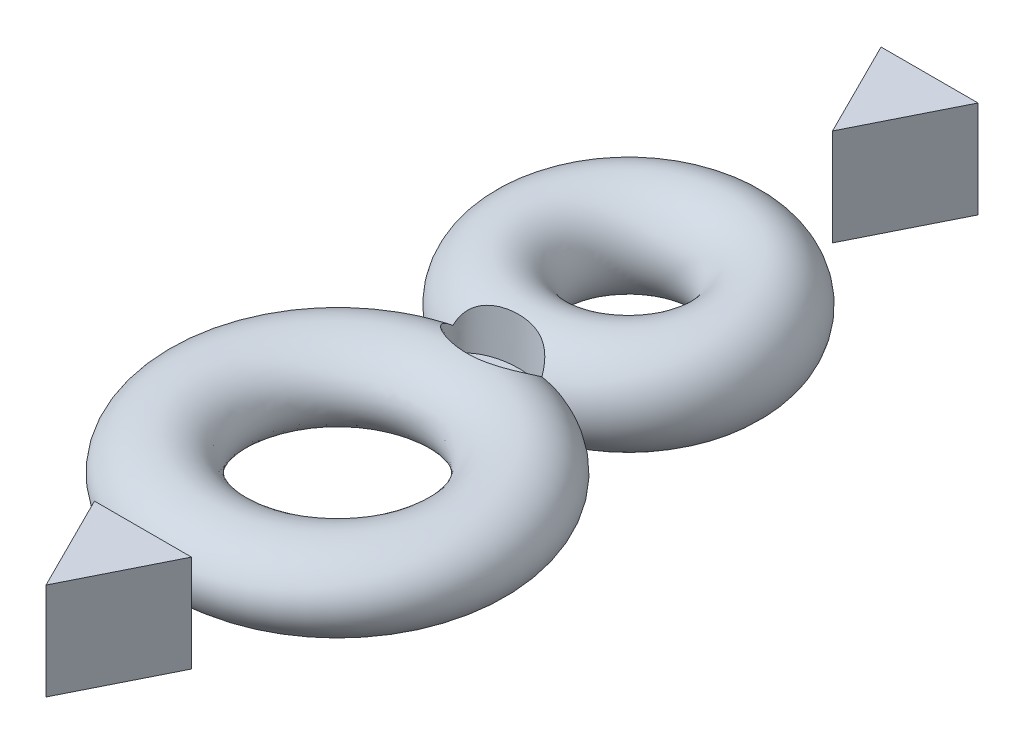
ISO-10303-21;
HEADER;
FILE_DESCRIPTION(('STEP AP214'),'2;1');
FILE_NAME('part.step','',(''),(''),'','','');
FILE_SCHEMA(('AUTOMOTIVE_DESIGN { 1 0 10303 214 1 1 1 1 }'));
ENDSEC;
DATA;
#1=APPLICATION_CONTEXT('core data for automotive mechanical design processes');
#2=APPLICATION_PROTOCOL_DEFINITION('international standard','automotive_design',2000,#1);
#3=PRODUCT_CONTEXT('',#1,'mechanical');
#4=PRODUCT('Part','Part','',(#3));
#5=PRODUCT_RELATED_PRODUCT_CATEGORY('part','',(#4));
#6=PRODUCT_DEFINITION_FORMATION('','',#4);
#7=PRODUCT_DEFINITION_CONTEXT('part definition',#1,'design');
#8=PRODUCT_DEFINITION('design','',#6,#7);
#9=PRODUCT_DEFINITION_SHAPE('','',#8);
#10=(LENGTH_UNIT() NAMED_UNIT(*) SI_UNIT(.MILLI.,.METRE.));
#11=(NAMED_UNIT(*) PLANE_ANGLE_UNIT() SI_UNIT($,.RADIAN.));
#12=(NAMED_UNIT(*) SI_UNIT($,.STERADIAN.) SOLID_ANGLE_UNIT());
#13=UNCERTAINTY_MEASURE_WITH_UNIT(LENGTH_MEASURE(1.E-05),#10,'distance_accuracy_value','');
#14=(GEOMETRIC_REPRESENTATION_CONTEXT(3) GLOBAL_UNCERTAINTY_ASSIGNED_CONTEXT((#13)) GLOBAL_UNIT_ASSIGNED_CONTEXT((#10,
#11,#12)) REPRESENTATION_CONTEXT('',''));
#15=CARTESIAN_POINT('',(0.,0.,0.));
#16=DIRECTION('',(0.,0.,1.));
#17=DIRECTION('',(1.,0.,0.));
#18=AXIS2_PLACEMENT_3D('',#15,#16,#17);
#19=CARTESIAN_POINT('',(0.,7.5,75.0979203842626));
#20=DIRECTION('',(0.894427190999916,0.,-0.447213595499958));
#21=DIRECTION('',(-0.447213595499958,0.,-0.894427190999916));
#22=AXIS2_PLACEMENT_3D('',#19,#20,#21);
#23=PLANE('',#22);
#24=DIRECTION('',(0.447213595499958,0.,0.894427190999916));
#25=VECTOR('',#24,1.);
#26=CARTESIAN_POINT('',(0.,-7.5,75.0979203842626));
#27=LINE('',#26,#25);
#28=CARTESIAN_POINT('',(-7.49999999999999,-7.5,60.0979203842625));
#29=VERTEX_POINT('',#28);
#30=CARTESIAN_POINT('',(0.,-7.5,75.0979203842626));
#31=VERTEX_POINT('',#30);
#32=EDGE_CURVE('E95',#29,#31,#27,.T.);
#33=ORIENTED_EDGE('',*,*,#32,.T.);
#34=DIRECTION('',(0.,-1.,0.));
#35=VECTOR('',#34,1.);
#36=CARTESIAN_POINT('',(0.,7.5,75.0979203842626));
#37=LINE('',#36,#35);
#38=CARTESIAN_POINT('',(0.,7.5,75.0979203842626));
#39=VERTEX_POINT('',#38);
#40=EDGE_CURVE('E12',#39,#31,#37,.T.);
#41=ORIENTED_EDGE('',*,*,#40,.F.);
#42=DIRECTION('',(0.447213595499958,0.,0.894427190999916));
#43=VECTOR('',#42,1.);
#44=CARTESIAN_POINT('',(0.,7.5,75.0979203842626));
#45=LINE('',#44,#43);
#46=CARTESIAN_POINT('',(-7.49999999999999,7.5,60.0979203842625));
#47=VERTEX_POINT('',#46);
#48=EDGE_CURVE('E88',#47,#39,#45,.T.);
#49=ORIENTED_EDGE('',*,*,#48,.F.);
#50=DIRECTION('',(0.,-1.,0.));
#51=VECTOR('',#50,1.);
#52=CARTESIAN_POINT('',(-7.49999999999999,7.5,60.0979203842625));
#53=LINE('',#52,#51);
#54=EDGE_CURVE('E96',#47,#29,#53,.T.);
#55=ORIENTED_EDGE('',*,*,#54,.T.);
#56=EDGE_LOOP('',(#33,#41,#49,#55));
#57=FACE_BOUND('',#56,.T.);
#58=ADVANCED_FACE('F48',(#57),#23,.F.);
#59=CARTESIAN_POINT('',(7.50000000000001,7.5,60.0979203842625));
#60=DIRECTION('',(-0.894427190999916,0.,-0.447213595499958));
#61=DIRECTION('',(-0.447213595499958,0.,0.894427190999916));
#62=AXIS2_PLACEMENT_3D('',#59,#60,#61);
#63=PLANE('',#62);
#64=DIRECTION('',(0.447213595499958,0.,-0.894427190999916));
#65=VECTOR('',#64,1.);
#66=CARTESIAN_POINT('',(7.50000000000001,-7.5,60.0979203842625));
#67=LINE('',#66,#65);
#68=CARTESIAN_POINT('',(7.50000000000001,-7.5,60.0979203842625));
#69=VERTEX_POINT('',#68);
#70=EDGE_CURVE('E76',#31,#69,#67,.T.);
#71=ORIENTED_EDGE('',*,*,#70,.T.);
#72=DIRECTION('',(0.,-1.,0.));
#73=VECTOR('',#72,1.);
#74=CARTESIAN_POINT('',(7.50000000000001,7.5,60.0979203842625));
#75=LINE('',#74,#73);
#76=CARTESIAN_POINT('',(7.50000000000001,7.5,60.0979203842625));
#77=VERTEX_POINT('',#76);
#78=EDGE_CURVE('E56',#77,#69,#75,.T.);
#79=ORIENTED_EDGE('',*,*,#78,.F.);
#80=DIRECTION('',(0.447213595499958,0.,-0.894427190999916));
#81=VECTOR('',#80,1.);
#82=CARTESIAN_POINT('',(7.50000000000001,7.5,60.0979203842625));
#83=LINE('',#82,#81);
#84=EDGE_CURVE('E84',#39,#77,#83,.T.);
#85=ORIENTED_EDGE('',*,*,#84,.F.);
#86=ORIENTED_EDGE('',*,*,#40,.T.);
#87=EDGE_LOOP('',(#71,#79,#85,#86));
#88=FACE_BOUND('',#87,.T.);
#89=ADVANCED_FACE('F85',(#88),#63,.F.);
#90=CARTESIAN_POINT('',(-7.49999999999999,7.5,60.0979203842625));
#91=DIRECTION('',(0.,0.,1.));
#92=DIRECTION('',(1.,0.,0.));
#93=AXIS2_PLACEMENT_3D('',#90,#91,#92);
#94=PLANE('',#93);
#95=DIRECTION('',(-1.,0.,0.));
#96=VECTOR('',#95,1.);
#97=CARTESIAN_POINT('',(-7.49999999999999,-7.5,60.0979203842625));
#98=LINE('',#97,#96);
#99=EDGE_CURVE('E81',#69,#29,#98,.T.);
#100=ORIENTED_EDGE('',*,*,#99,.T.);
#101=ORIENTED_EDGE('',*,*,#54,.F.);
#102=DIRECTION('',(-1.,0.,0.));
#103=VECTOR('',#102,1.);
#104=CARTESIAN_POINT('',(-7.49999999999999,7.5,60.0979203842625));
#105=LINE('',#104,#103);
#106=EDGE_CURVE('E64',#77,#47,#105,.T.);
#107=ORIENTED_EDGE('',*,*,#106,.F.);
#108=ORIENTED_EDGE('',*,*,#78,.T.);
#109=EDGE_LOOP('',(#100,#101,#107,#108));
#110=FACE_BOUND('',#109,.T.);
#111=ADVANCED_FACE('F103',(#110),#94,.F.);
#112=CARTESIAN_POINT('',(0.,7.5,0.));
#113=DIRECTION('',(0.,-1.,0.));
#114=DIRECTION('',(0.,0.,-1.));
#115=AXIS2_PLACEMENT_3D('',#112,#113,#114);
#116=PLANE('',#115);
#117=ORIENTED_EDGE('',*,*,#48,.T.);
#118=ORIENTED_EDGE('',*,*,#84,.T.);
#119=ORIENTED_EDGE('',*,*,#106,.T.);
#120=EDGE_LOOP('',(#117,#118,#119));
#121=FACE_BOUND('',#120,.T.);
#122=ADVANCED_FACE('F91',(#121),#116,.F.);
#123=CARTESIAN_POINT('',(0.,-7.5,0.));
#124=DIRECTION('',(0.,-1.,0.));
#125=DIRECTION('',(0.,0.,-1.));
#126=AXIS2_PLACEMENT_3D('',#123,#124,#125);
#127=PLANE('',#126);
#128=ORIENTED_EDGE('',*,*,#32,.F.);
#129=ORIENTED_EDGE('',*,*,#99,.F.);
#130=ORIENTED_EDGE('',*,*,#70,.F.);
#131=EDGE_LOOP('',(#128,#129,#130));
#132=FACE_BOUND('',#131,.T.);
#133=ADVANCED_FACE('F104',(#132),#127,.T.);
#134=CLOSED_SHELL('',(#58,#89,#111,#122,#133));
#135=MANIFOLD_SOLID_BREP('B2',#134);
#136=CARTESIAN_POINT('',(7.49999999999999,7.5,-61.5769876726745));
#137=DIRECTION('',(0.,0.,1.));
#138=DIRECTION('',(1.,0.,0.));
#139=AXIS2_PLACEMENT_3D('',#136,#137,#138);
#140=PLANE('',#139);
#141=DIRECTION('',(-1.,0.,0.));
#142=VECTOR('',#141,1.);
#143=CARTESIAN_POINT('',(7.49999999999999,-7.5,-61.5769876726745));
#144=LINE('',#143,#142);
#145=CARTESIAN_POINT('',(7.49999999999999,-7.5,-61.5769876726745));
#146=VERTEX_POINT('',#145);
#147=CARTESIAN_POINT('',(-7.50000000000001,-7.5,-61.5769876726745));
#148=VERTEX_POINT('',#147);
#149=EDGE_CURVE('E202',#146,#148,#144,.T.);
#150=ORIENTED_EDGE('',*,*,#149,.T.);
#151=DIRECTION('',(0.,-1.,0.));
#152=VECTOR('',#151,1.);
#153=CARTESIAN_POINT('',(-7.50000000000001,7.5,-61.5769876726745));
#154=LINE('',#153,#152);
#155=CARTESIAN_POINT('',(-7.50000000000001,7.5,-61.5769876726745));
#156=VERTEX_POINT('',#155);
#157=EDGE_CURVE('E46',#156,#148,#154,.T.);
#158=ORIENTED_EDGE('',*,*,#157,.F.);
#159=DIRECTION('',(-1.,0.,0.));
#160=VECTOR('',#159,1.);
#161=CARTESIAN_POINT('',(7.49999999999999,7.5,-61.5769876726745));
#162=LINE('',#161,#160);
#163=CARTESIAN_POINT('',(7.49999999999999,7.5,-61.5769876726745));
#164=VERTEX_POINT('',#163);
#165=EDGE_CURVE('E195',#164,#156,#162,.T.);
#166=ORIENTED_EDGE('',*,*,#165,.F.);
#167=DIRECTION('',(0.,-1.,0.));
#168=VECTOR('',#167,1.);
#169=CARTESIAN_POINT('',(7.49999999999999,7.5,-61.5769876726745));
#170=LINE('',#169,#168);
#171=EDGE_CURVE('E203',#164,#146,#170,.T.);
#172=ORIENTED_EDGE('',*,*,#171,.T.);
#173=EDGE_LOOP('',(#150,#158,#166,#172));
#174=FACE_BOUND('',#173,.T.);
#175=ADVANCED_FACE('F155',(#174),#140,.F.);
#176=CARTESIAN_POINT('',(-7.50000000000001,7.5,-61.5769876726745));
#177=DIRECTION('',(0.894427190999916,0.,-0.447213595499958));
#178=DIRECTION('',(-0.447213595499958,0.,-0.894427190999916));
#179=AXIS2_PLACEMENT_3D('',#176,#177,#178);
#180=PLANE('',#179);
#181=DIRECTION('',(0.447213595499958,0.,0.894427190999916));
#182=VECTOR('',#181,1.);
#183=CARTESIAN_POINT('',(-7.50000000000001,-7.5,-61.5769876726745));
#184=LINE('',#183,#182);
#185=CARTESIAN_POINT('',(0.,-7.5,-46.5769876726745));
#186=VERTEX_POINT('',#185);
#187=EDGE_CURVE('E183',#148,#186,#184,.T.);
#188=ORIENTED_EDGE('',*,*,#187,.T.);
#189=DIRECTION('',(0.,-1.,0.));
#190=VECTOR('',#189,1.);
#191=CARTESIAN_POINT('',(0.,7.5,-46.5769876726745));
#192=LINE('',#191,#190);
#193=CARTESIAN_POINT('',(0.,7.5,-46.5769876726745));
#194=VERTEX_POINT('',#193);
#195=EDGE_CURVE('E163',#194,#186,#192,.T.);
#196=ORIENTED_EDGE('',*,*,#195,.F.);
#197=DIRECTION('',(0.447213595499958,0.,0.894427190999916));
#198=VECTOR('',#197,1.);
#199=CARTESIAN_POINT('',(-7.50000000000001,7.5,-61.5769876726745));
#200=LINE('',#199,#198);
#201=EDGE_CURVE('E191',#156,#194,#200,.T.);
#202=ORIENTED_EDGE('',*,*,#201,.F.);
#203=ORIENTED_EDGE('',*,*,#157,.T.);
#204=EDGE_LOOP('',(#188,#196,#202,#203));
#205=FACE_BOUND('',#204,.T.);
#206=ADVANCED_FACE('F192',(#205),#180,.F.);
#207=CARTESIAN_POINT('',(0.,7.5,-46.5769876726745));
#208=DIRECTION('',(-0.894427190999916,0.,-0.447213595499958));
#209=DIRECTION('',(-0.447213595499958,0.,0.894427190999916));
#210=AXIS2_PLACEMENT_3D('',#207,#208,#209);
#211=PLANE('',#210);
#212=DIRECTION('',(0.447213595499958,0.,-0.894427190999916));
#213=VECTOR('',#212,1.);
#214=CARTESIAN_POINT('',(0.,-7.5,-46.5769876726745));
#215=LINE('',#214,#213);
#216=EDGE_CURVE('E188',#186,#146,#215,.T.);
#217=ORIENTED_EDGE('',*,*,#216,.T.);
#218=ORIENTED_EDGE('',*,*,#171,.F.);
#219=DIRECTION('',(0.447213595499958,0.,-0.894427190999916));
#220=VECTOR('',#219,1.);
#221=CARTESIAN_POINT('',(0.,7.5,-46.5769876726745));
#222=LINE('',#221,#220);
#223=EDGE_CURVE('E171',#194,#164,#222,.T.);
#224=ORIENTED_EDGE('',*,*,#223,.F.);
#225=ORIENTED_EDGE('',*,*,#195,.T.);
#226=EDGE_LOOP('',(#217,#218,#224,#225));
#227=FACE_BOUND('',#226,.T.);
#228=ADVANCED_FACE('F210',(#227),#211,.F.);
#229=CARTESIAN_POINT('',(0.,7.5,0.));
#230=DIRECTION('',(0.,1.,0.));
#231=DIRECTION('',(0.,0.,1.));
#232=AXIS2_PLACEMENT_3D('',#229,#230,#231);
#233=PLANE('',#232);
#234=ORIENTED_EDGE('',*,*,#165,.T.);
#235=ORIENTED_EDGE('',*,*,#201,.T.);
#236=ORIENTED_EDGE('',*,*,#223,.T.);
#237=EDGE_LOOP('',(#234,#235,#236));
#238=FACE_BOUND('',#237,.T.);
#239=ADVANCED_FACE('F198',(#238),#233,.T.);
#240=CARTESIAN_POINT('',(0.,-7.5,0.));
#241=DIRECTION('',(0.,1.,0.));
#242=DIRECTION('',(0.,0.,1.));
#243=AXIS2_PLACEMENT_3D('',#240,#241,#242);
#244=PLANE('',#243);
#245=ORIENTED_EDGE('',*,*,#149,.F.);
#246=ORIENTED_EDGE('',*,*,#216,.F.);
#247=ORIENTED_EDGE('',*,*,#187,.F.);
#248=EDGE_LOOP('',(#245,#246,#247));
#249=FACE_BOUND('',#248,.T.);
#250=ADVANCED_FACE('F211',(#249),#244,.F.);
#251=CLOSED_SHELL('',(#175,#206,#228,#239,#250));
#252=MANIFOLD_SOLID_BREP('B6',#251);
#253=CARTESIAN_POINT('',(0.,0.,-15.));
#254=DIRECTION('',(0.,-1.,0.));
#255=DIRECTION('',(0.,0.,-1.));
#256=AXIS2_PLACEMENT_3D('',#253,#254,#255);
#257=TOROIDAL_SURFACE('',#256,15.,7.5);
#258=CARTESIAN_POINT('',(6.96586415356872,0.,6.39454922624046));
#259=CARTESIAN_POINT('',(6.96585164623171,0.0956341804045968,6.39455496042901));
#260=CARTESIAN_POINT('',(6.96621750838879,0.191265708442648,6.39251053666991));
#261=CARTESIAN_POINT('',(6.96761457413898,0.382342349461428,6.38436410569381));
#262=CARTESIAN_POINT('',(6.96864571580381,0.477787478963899,6.37826247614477));
#263=CARTESIAN_POINT('',(6.97128111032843,0.668265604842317,6.36204966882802));
#264=CARTESIAN_POINT('',(6.97288498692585,0.763298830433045,6.3519411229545));
#265=CARTESIAN_POINT('',(6.9764873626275,0.952852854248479,6.32779737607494));
#266=CARTESIAN_POINT('',(6.97848586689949,1.04737364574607,6.31376212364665));
#267=CARTESIAN_POINT('',(6.98471269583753,1.32858380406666,6.26614551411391));
#268=CARTESIAN_POINT('',(6.98919812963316,1.51433817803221,6.22692985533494));
#269=CARTESIAN_POINT('',(6.99651225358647,1.88229909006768,6.13443042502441));
#270=CARTESIAN_POINT('',(6.9993411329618,2.06450603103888,6.08114826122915));
#271=CARTESIAN_POINT('',(7.00018887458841,2.33789927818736,5.99048727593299));
#272=CARTESIAN_POINT('',(6.99986806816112,2.43066219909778,5.95780679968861));
#273=CARTESIAN_POINT('',(6.99757077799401,2.61492084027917,5.88917646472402));
#274=CARTESIAN_POINT('',(6.99559470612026,2.70641687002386,5.85322742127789));
#275=CARTESIAN_POINT('',(6.98650096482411,2.97932400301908,5.7405550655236));
#276=CARTESIAN_POINT('',(6.9762126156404,3.15874614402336,5.65914306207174));
#277=CARTESIAN_POINT('',(6.94597858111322,3.48481823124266,5.4984860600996));
#278=CARTESIAN_POINT('',(6.92770481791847,3.63236043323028,5.42073354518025));
#279=CARTESIAN_POINT('',(6.88020790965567,3.92192445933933,5.25859301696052));
#280=CARTESIAN_POINT('',(6.85098861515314,4.06394820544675,5.17420734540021));
#281=CARTESIAN_POINT('',(6.7796709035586,4.34118207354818,5.00033806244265));
#282=CARTESIAN_POINT('',(6.7375948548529,4.47640355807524,4.91086352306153));
#283=CARTESIAN_POINT('',(6.63896366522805,4.73894848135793,4.72839067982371));
#284=CARTESIAN_POINT('',(6.58241496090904,4.86627539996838,4.63539395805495));
#285=CARTESIAN_POINT('',(6.46950430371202,5.08185520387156,4.47060301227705));
#286=CARTESIAN_POINT('',(6.41642698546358,5.17209217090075,4.39913992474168));
#287=CARTESIAN_POINT('',(6.30132486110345,5.34666884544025,4.25623109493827));
#288=CARTESIAN_POINT('',(6.2393018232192,5.43100971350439,4.18478535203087));
#289=CARTESIAN_POINT('',(6.10646432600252,5.59331453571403,4.04283129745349));
#290=CARTESIAN_POINT('',(6.03564994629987,5.67127854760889,3.97232297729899));
#291=CARTESIAN_POINT('',(5.88565420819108,5.82049113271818,3.83312244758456));
#292=CARTESIAN_POINT('',(5.80647261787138,5.89173951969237,3.76443028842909));
#293=CARTESIAN_POINT('',(5.64061215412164,6.02717037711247,3.62983237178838));
#294=CARTESIAN_POINT('',(5.55395403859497,6.09137135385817,3.56391961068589));
#295=CARTESIAN_POINT('',(5.37373930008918,6.2129528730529,3.43532882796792));
#296=CARTESIAN_POINT('',(5.28018241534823,6.27033315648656,3.37265092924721));
#297=CARTESIAN_POINT('',(5.08701072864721,6.37847197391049,3.25101980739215));
#298=CARTESIAN_POINT('',(4.98739512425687,6.42922962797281,3.1920670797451));
#299=CARTESIAN_POINT('',(4.78295531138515,6.52445449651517,3.07823221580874));
#300=CARTESIAN_POINT('',(4.67812978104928,6.56892010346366,3.0233511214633));
#301=CARTESIAN_POINT('',(4.41465117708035,6.6711589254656,2.8935354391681));
#302=CARTESIAN_POINT('',(4.25349191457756,6.72559724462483,2.82104145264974));
#303=CARTESIAN_POINT('',(3.92418350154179,6.8233963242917,2.68561816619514));
#304=CARTESIAN_POINT('',(3.75603922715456,6.86676466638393,2.62268233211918));
#305=CARTESIAN_POINT('',(3.41470960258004,6.94399575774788,2.50637057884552));
#306=CARTESIAN_POINT('',(3.24153298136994,6.97787399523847,2.45297913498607));
#307=CARTESIAN_POINT('',(2.89125320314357,7.03768169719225,2.35543999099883));
#308=CARTESIAN_POINT('',(2.7141494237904,7.06360989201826,2.31129376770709));
#309=CARTESIAN_POINT('',(2.35731780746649,7.10876159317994,2.23205118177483));
#310=CARTESIAN_POINT('',(2.17759309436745,7.12799249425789,2.19694484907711));
#311=CARTESIAN_POINT('',(1.81617108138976,7.16083358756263,2.13547489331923));
#312=CARTESIAN_POINT('',(1.63447387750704,7.17444405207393,2.10911084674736));
#313=CARTESIAN_POINT('',(1.26984339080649,7.19684081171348,2.06492626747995));
#314=CARTESIAN_POINT('',(1.08691071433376,7.20562932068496,2.04710181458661));
#315=CARTESIAN_POINT('',(0.720272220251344,7.21893873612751,2.01982939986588));
#316=CARTESIAN_POINT('',(0.536566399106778,7.22345962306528,2.0103814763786));
#317=CARTESIAN_POINT('',(0.168887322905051,7.22852523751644,1.99978140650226));
#318=CARTESIAN_POINT('',(-0.0150858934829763,7.22907049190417,1.99862816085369));
#319=CARTESIAN_POINT('',(-0.382869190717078,7.22622191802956,2.00460449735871));
#320=CARTESIAN_POINT('',(-0.566679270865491,7.2228280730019,2.01173411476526));
#321=CARTESIAN_POINT('',(-0.933695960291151,7.21187997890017,2.03433990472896));
#322=CARTESIAN_POINT('',(-1.11690246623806,7.20432505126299,2.04981743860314));
#323=CARTESIAN_POINT('',(-1.48215490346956,7.18457840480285,2.08925047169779));
#324=CARTESIAN_POINT('',(-1.66420085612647,7.17238677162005,2.11320581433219));
#325=CARTESIAN_POINT('',(-2.02659866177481,7.1426302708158,2.16979997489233));
#326=CARTESIAN_POINT('',(-2.20694966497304,7.12506284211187,2.20244293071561));
#327=CARTESIAN_POINT('',(-2.56511078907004,7.08357609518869,2.27664876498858));
#328=CARTESIAN_POINT('',(-2.74292062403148,7.05965606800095,2.31821263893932));
#329=CARTESIAN_POINT('',(-3.09520013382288,7.00421901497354,2.41056713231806));
#330=CARTESIAN_POINT('',(-3.26966525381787,6.97269232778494,2.46136946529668));
#331=CARTESIAN_POINT('',(-3.61365484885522,6.90065354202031,2.57235833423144));
#332=CARTESIAN_POINT('',(-3.78318137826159,6.86014524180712,2.63254090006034));
#333=CARTESIAN_POINT('',(-4.09465185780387,6.77438311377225,2.75416659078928));
#334=CARTESIAN_POINT('',(-4.23737411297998,6.73037594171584,2.81448926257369));
#335=CARTESIAN_POINT('',(-4.51659712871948,6.63322283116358,2.94233029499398));
#336=CARTESIAN_POINT('',(-4.65309109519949,6.58006720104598,3.00985625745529));
#337=CARTESIAN_POINT('',(-4.90022601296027,6.47154275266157,3.14214455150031));
#338=CARTESIAN_POINT('',(-5.01187442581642,6.41743405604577,3.20605623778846));
#339=CARTESIAN_POINT('',(-5.22805689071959,6.30119255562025,3.33855715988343));
#340=CARTESIAN_POINT('',(-5.33258961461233,6.239058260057,3.40714726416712));
#341=CARTESIAN_POINT('',(-5.53332026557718,6.10650368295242,3.54833249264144));
#342=CARTESIAN_POINT('',(-5.62952118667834,6.03608639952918,3.62092616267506));
#343=CARTESIAN_POINT('',(-5.81255766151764,5.88690735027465,3.76927658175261));
#344=CARTESIAN_POINT('',(-5.89939423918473,5.80814649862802,3.84503298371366));
#345=CARTESIAN_POINT('',(-6.0598365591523,5.64557370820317,3.99581356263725));
#346=CARTESIAN_POINT('',(-6.13381287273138,5.56205633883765,4.07076118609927));
#347=CARTESIAN_POINT('',(-6.27182934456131,5.38793009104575,4.22155055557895));
#348=CARTESIAN_POINT('',(-6.33586975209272,5.29732139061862,4.29739227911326));
#349=CARTESIAN_POINT('',(-6.45388285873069,5.10961733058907,4.44886372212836));
#350=CARTESIAN_POINT('',(-6.5078555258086,5.01252195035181,4.52449344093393));
#351=CARTESIAN_POINT('',(-6.60595902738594,4.81254639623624,4.67446489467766));
#352=CARTESIAN_POINT('',(-6.65008875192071,4.70966557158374,4.74880648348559));
#353=CARTESIAN_POINT('',(-6.73724906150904,4.47691207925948,4.91043076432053));
#354=CARTESIAN_POINT('',(-6.77814295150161,4.34587520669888,4.99718995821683));
#355=CARTESIAN_POINT('',(-6.84777645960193,4.07760085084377,5.16583646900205));
#356=CARTESIAN_POINT('',(-6.87651311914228,3.94036186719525,5.24772259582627));
#357=CARTESIAN_POINT('',(-6.92369313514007,3.66028939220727,5.40555863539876));
#358=CARTESIAN_POINT('',(-6.94210616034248,3.51744072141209,5.48149049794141));
#359=CARTESIAN_POINT('',(-6.97051822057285,3.22722786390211,5.62611389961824));
#360=CARTESIAN_POINT('',(-6.98051157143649,3.07986069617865,5.6948005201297));
#361=CARTESIAN_POINT('',(-6.99611740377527,2.7377975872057,5.84275283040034));
#362=CARTESIAN_POINT('',(-6.99960725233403,2.54181402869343,5.91927609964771));
#363=CARTESIAN_POINT('',(-7.00032994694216,2.14456336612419,6.05676188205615));
#364=CARTESIAN_POINT('',(-6.99756498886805,1.94329814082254,6.11772984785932));
#365=CARTESIAN_POINT('',(-6.98977894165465,1.53693304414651,6.22235873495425));
#366=CARTESIAN_POINT('',(-6.98476453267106,1.33184623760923,6.26607018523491));
#367=CARTESIAN_POINT('',(-6.97793657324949,1.0220216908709,6.31778671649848));
#368=CARTESIAN_POINT('',(-6.97577669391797,0.918409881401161,6.33271491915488));
#369=CARTESIAN_POINT('',(-6.97196833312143,0.710604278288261,6.35784147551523));
#370=CARTESIAN_POINT('',(-6.9703198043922,0.606410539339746,6.36804026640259));
#371=CARTESIAN_POINT('',(-6.96800570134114,0.41851025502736,6.38205385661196));
#372=CARTESIAN_POINT('',(-6.9672095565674,0.33486884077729,6.38673693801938));
#373=CARTESIAN_POINT('',(-6.96613531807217,0.16748610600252,6.39298579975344));
#374=CARTESIAN_POINT('',(-6.96585710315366,0.0837448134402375,6.39455230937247));
#375=CARTESIAN_POINT('',(-6.96586415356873,0.,6.39454922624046));
#376=B_SPLINE_CURVE_WITH_KNOTS('',3,(#258,#259,#260,#261,#262,#263,#264,#265,#266,#267,#268,
#269,#270,#271,#272,#273,#274,#275,#276,#277,#278,#279,#280,#281,#282,#283,#284,#285,#286,#287,
#288,#289,#290,#291,#292,#293,#294,#295,#296,#297,#298,#299,#300,#301,#302,#303,#304,#305,#306,
#307,#308,#309,#310,#311,#312,#313,#314,#315,#316,#317,#318,#319,#320,#321,#322,#323,#324,#325,
#326,#327,#328,#329,#330,#331,#332,#333,#334,#335,#336,#337,#338,#339,#340,#341,#342,#343,#344,
#345,#346,#347,#348,#349,#350,#351,#352,#353,#354,#355,#356,#357,#358,#359,#360,#361,#362,#363,
#364,#365,#366,#367,#368,#369,#370,#371,#372,#373,#374,#375),.UNSPECIFIED.,.F.,.F.,(4,2,2,2,2,2,
2,2,2,2,2,2,2,2,2,2,2,2,2,2,2,2,2,2,2,2,2,2,2,2,2,2,2,2,2,2,2,2,2,2,2,2,2,2,2,2,2,2,2,2,2,2,2,2,
2,2,2,2,4),(0.,0.286875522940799,0.573724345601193,0.860385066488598,1.14704954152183,
1.71612303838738,2.2851315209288,2.58011826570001,2.87503163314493,3.46614560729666,
3.96897146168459,4.4716205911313,4.97340013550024,5.4749569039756,5.85480324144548,
6.23457460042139,6.61434251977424,6.99412096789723,7.37287698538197,7.75164738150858,
8.13046805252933,8.50938533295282,9.06325450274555,9.61674331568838,10.1693234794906,
10.7219918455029,11.2740480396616,11.8260774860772,12.3778532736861,12.9296315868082,
13.4813367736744,14.0330443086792,14.5848418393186,15.1366291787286,15.6886798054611,
16.2407920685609,16.7936093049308,17.3461931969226,17.8289444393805,18.3122102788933,
18.7304520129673,19.1487715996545,19.5669402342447,19.9850630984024,20.3877209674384,
20.7903687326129,21.1930177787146,21.5957122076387,22.0821431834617,22.5686924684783,
23.056663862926,23.5449644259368,24.1754348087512,24.8056838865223,25.4340735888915,
25.7480959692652,26.0620893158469,26.3133608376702,26.5645735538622),.UNSPECIFIED.);
#377=CARTESIAN_POINT('',(6.87881097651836,3.918585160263,5.2589120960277));
#378=VERTEX_POINT('',#377);
#379=CARTESIAN_POINT('',(-6.87881097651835,3.918585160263,5.2589120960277));
#380=VERTEX_POINT('',#379);
#381=EDGE_CURVE('E274',#378,#380,#376,.T.);
#382=ORIENTED_EDGE('',*,*,#381,.F.);
#383=CARTESIAN_POINT('',(0.,-4.90241131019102,5.67594603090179));
#384=CARTESIAN_POINT('',(0.348120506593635,-4.90241425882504,5.67594480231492));
#385=CARTESIAN_POINT('',(0.696255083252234,-4.89626338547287,5.67247561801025));
#386=CARTESIAN_POINT('',(1.39199863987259,-4.87137814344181,5.65870358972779));
#387=CARTESIAN_POINT('',(1.73960751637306,-4.85264155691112,5.64839954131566));
#388=CARTESIAN_POINT('',(2.4337869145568,-4.80169622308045,5.62126639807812));
#389=CARTESIAN_POINT('',(2.78035676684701,-4.76948013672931,5.60443374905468));
#390=CARTESIAN_POINT('',(3.47133587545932,-4.6901052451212,5.56474466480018));
#391=CARTESIAN_POINT('',(3.81574585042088,-4.64295171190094,5.54189035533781));
#392=CARTESIAN_POINT('',(4.50126457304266,-4.53156131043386,5.49080729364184));
#393=CARTESIAN_POINT('',(4.8423747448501,-4.46733218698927,5.46258097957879));
#394=CARTESIAN_POINT('',(5.51957917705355,-4.31889098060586,5.40153488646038));
#395=CARTESIAN_POINT('',(5.85567764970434,-4.23469681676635,5.36871923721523));
#396=CARTESIAN_POINT('',(6.43871486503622,-4.06603288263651,5.30793223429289));
#397=CARTESIAN_POINT('',(6.68722730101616,-3.98673708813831,5.28075805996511));
#398=CARTESIAN_POINT('',(7.17862450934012,-3.81229991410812,5.22477220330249));
#399=CARTESIAN_POINT('',(7.42150706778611,-3.71715241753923,5.19595989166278));
#400=CARTESIAN_POINT('',(7.89785450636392,-3.50891539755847,5.13746231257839));
#401=CARTESIAN_POINT('',(8.13136328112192,-3.39592587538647,5.10778262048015));
#402=CARTESIAN_POINT('',(8.58656104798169,-3.1485112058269,5.04821711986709));
#403=CARTESIAN_POINT('',(8.80826429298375,-3.01411272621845,5.01833161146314));
#404=CARTESIAN_POINT('',(9.19446478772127,-2.74758888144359,4.96499295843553));
#405=CARTESIAN_POINT('',(9.36188614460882,-2.61977663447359,4.94138583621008));
#406=CARTESIAN_POINT('',(9.6810688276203,-2.34507389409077,4.89561894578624));
#407=CARTESIAN_POINT('',(9.83281123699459,-2.19816082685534,4.87346093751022));
#408=CARTESIAN_POINT('',(10.1156064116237,-1.88143626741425,4.83160026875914));
#409=CARTESIAN_POINT('',(10.2463902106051,-1.71137207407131,4.81193012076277));
#410=CARTESIAN_POINT('',(10.4178877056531,-1.44065016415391,4.78587832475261));
#411=CARTESIAN_POINT('',(10.4709102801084,-1.34787989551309,4.77777470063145));
#412=CARTESIAN_POINT('',(10.5674461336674,-1.15739572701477,4.76295820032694));
#413=CARTESIAN_POINT('',(10.6109643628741,-1.05968443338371,4.75624460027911));
#414=CARTESIAN_POINT('',(10.6755229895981,-0.890410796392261,4.74625356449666));
#415=CARTESIAN_POINT('',(10.6993740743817,-0.819935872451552,4.74255210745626));
#416=CARTESIAN_POINT('',(10.7413834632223,-0.677275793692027,4.73602138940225));
#417=CARTESIAN_POINT('',(10.7595432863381,-0.605091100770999,4.73319189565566));
#418=CARTESIAN_POINT('',(10.7898081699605,-0.459452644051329,4.72847089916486));
#419=CARTESIAN_POINT('',(10.8019151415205,-0.385999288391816,4.72657910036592));
#420=CARTESIAN_POINT('',(10.8198210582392,-0.238335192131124,4.72377964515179));
#421=CARTESIAN_POINT('',(10.8256225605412,-0.164124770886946,4.72287158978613));
#422=CARTESIAN_POINT('',(10.8308017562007,-0.0152979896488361,4.72206098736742));
#423=CARTESIAN_POINT('',(10.8301642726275,0.0593189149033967,4.72216081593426));
#424=CARTESIAN_POINT('',(10.8224446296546,0.208202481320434,4.7233688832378));
#425=CARTESIAN_POINT('',(10.8153629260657,0.282469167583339,4.72447705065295));
#426=CARTESIAN_POINT('',(10.7949089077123,0.430125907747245,4.72767374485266));
#427=CARTESIAN_POINT('',(10.7815351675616,0.503515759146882,4.72976249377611));
#428=CARTESIAN_POINT('',(10.7487847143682,0.648919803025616,4.73486814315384));
#429=CARTESIAN_POINT('',(10.7294057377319,0.720933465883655,4.73788539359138));
#430=CARTESIAN_POINT('',(10.6635912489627,0.931728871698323,4.74810848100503));
#431=CARTESIAN_POINT('',(10.6090766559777,1.06799071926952,4.75654904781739));
#432=CARTESIAN_POINT('',(10.4816801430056,1.33147316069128,4.77613461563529));
#433=CARTESIAN_POINT('',(10.4087703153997,1.45867963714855,4.78728372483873));
#434=CARTESIAN_POINT('',(10.2630161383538,1.68046775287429,4.80937869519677));
#435=CARTESIAN_POINT('',(10.1926462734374,1.77673602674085,4.81998185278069));
#436=CARTESIAN_POINT('',(10.0438193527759,1.96251433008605,4.84222934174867));
#437=CARTESIAN_POINT('',(9.96536856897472,2.05202950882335,4.85387286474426));
#438=CARTESIAN_POINT('',(9.80153752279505,2.22482258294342,4.87797426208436));
#439=CARTESIAN_POINT('',(9.71613749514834,2.30808129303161,4.89043443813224));
#440=CARTESIAN_POINT('',(9.53978502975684,2.46840874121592,4.91591585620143));
#441=CARTESIAN_POINT('',(9.4488310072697,2.54547569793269,4.92893725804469));
#442=CARTESIAN_POINT('',(9.19797720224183,2.74499929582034,4.96447163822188));
#443=CARTESIAN_POINT('',(9.03382607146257,2.8620638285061,4.98733161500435));
#444=CARTESIAN_POINT('',(8.69602617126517,3.08147990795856,5.03341749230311));
#445=CARTESIAN_POINT('',(8.52237142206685,3.18382204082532,5.0566436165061));
#446=CARTESIAN_POINT('',(8.16782433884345,3.37565173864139,5.10298231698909));
#447=CARTESIAN_POINT('',(7.9869223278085,3.46512133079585,5.12609469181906));
#448=CARTESIAN_POINT('',(7.61989859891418,3.63257626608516,5.17178490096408));
#449=CARTESIAN_POINT('',(7.43377779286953,3.71056360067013,5.19436282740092));
#450=CARTESIAN_POINT('',(7.05632074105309,3.85688222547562,5.23883185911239));
#451=CARTESIAN_POINT('',(6.86495851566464,3.92514767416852,5.26071756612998));
#452=CARTESIAN_POINT('',(6.47908598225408,4.05258373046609,5.30340080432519));
#453=CARTESIAN_POINT('',(6.28457501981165,4.11175241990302,5.32419810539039));
#454=CARTESIAN_POINT('',(5.89299443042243,4.22199719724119,5.36450066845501));
#455=CARTESIAN_POINT('',(5.69592299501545,4.27306718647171,5.38400495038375));
#456=CARTESIAN_POINT('',(5.29987688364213,4.36788641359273,5.42151808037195));
#457=CARTESIAN_POINT('',(5.10090198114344,4.41163476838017,5.43952674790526));
#458=CARTESIAN_POINT('',(4.5004025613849,4.53324644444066,5.49116595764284));
#459=CARTESIAN_POINT('',(4.09661536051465,4.60111841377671,5.52227288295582));
#460=CARTESIAN_POINT('',(3.28565965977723,4.71461146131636,5.57655923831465));
#461=CARTESIAN_POINT('',(2.87849249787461,4.76024095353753,5.59974166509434));
#462=CARTESIAN_POINT('',(2.12469473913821,4.82666118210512,5.63440422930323));
#463=CARTESIAN_POINT('',(1.77835704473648,4.85018810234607,5.64713383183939));
#464=CARTESIAN_POINT('',(1.08474964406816,4.88446949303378,5.66589259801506));
#465=CARTESIAN_POINT('',(0.737479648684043,4.89521939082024,5.67191936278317));
#466=CARTESIAN_POINT('',(0.0425093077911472,4.90443572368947,5.67707788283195));
#467=CARTESIAN_POINT('',(-0.305191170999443,4.90289440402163,5.67620528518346));
#468=CARTESIAN_POINT('',(-1.00053208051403,4.88743086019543,5.66757864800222));
#469=CARTESIAN_POINT('',(-1.34817220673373,4.8734980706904,5.65981873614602));
#470=CARTESIAN_POINT('',(-2.04267061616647,4.83257932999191,5.63764351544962));
#471=CARTESIAN_POINT('',(-2.38952837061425,4.8055862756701,5.62322458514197));
#472=CARTESIAN_POINT('',(-3.08139929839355,4.73731186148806,5.58816761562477));
#473=CARTESIAN_POINT('',(-3.42641315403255,4.6960362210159,5.56753206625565));
#474=CARTESIAN_POINT('',(-4.11336437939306,4.59736052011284,5.52065428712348));
#475=CARTESIAN_POINT('',(-4.45530485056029,4.53997919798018,5.49441858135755));
#476=CARTESIAN_POINT('',(-5.13481407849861,4.40651414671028,5.43706720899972));
#477=CARTESIAN_POINT('',(-5.47238689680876,4.33044933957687,5.40595649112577));
#478=CARTESIAN_POINT('',(-6.1136856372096,4.16329013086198,5.3424293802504));
#479=CARTESIAN_POINT('',(-6.41789977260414,4.073961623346,5.31033437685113));
#480=CARTESIAN_POINT('',(-7.01902265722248,3.87289932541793,5.2434826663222));
#481=CARTESIAN_POINT('',(-7.31592508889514,3.76114687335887,5.2087237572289));
#482=CARTESIAN_POINT('',(-7.75117257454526,3.57383549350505,5.15555036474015));
#483=CARTESIAN_POINT('',(-7.89398683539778,3.50843592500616,5.13773102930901));
#484=CARTESIAN_POINT('',(-8.17603725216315,3.37028281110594,5.101861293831));
#485=CARTESIAN_POINT('',(-8.31527289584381,3.2975282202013,5.08381086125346));
#486=CARTESIAN_POINT('',(-8.5889529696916,3.14406025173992,5.04771374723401));
#487=CARTESIAN_POINT('',(-8.72340612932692,3.06336250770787,5.02966712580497));
#488=CARTESIAN_POINT('',(-8.98654941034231,2.89308062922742,4.99379536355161));
#489=CARTESIAN_POINT('',(-9.11524221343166,2.80350069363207,4.97597012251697));
#490=CARTESIAN_POINT('',(-9.33747218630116,2.63557713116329,4.94475975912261));
#491=CARTESIAN_POINT('',(-9.43245475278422,2.55917548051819,4.93127006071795));
#492=CARTESIAN_POINT('',(-9.61701928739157,2.40005927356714,4.90479985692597));
#493=CARTESIAN_POINT('',(-9.70660093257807,2.31734434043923,4.89181938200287));
#494=CARTESIAN_POINT('',(-9.96530651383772,2.05932395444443,4.85399832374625));
#495=CARTESIAN_POINT('',(-10.1248884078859,1.87377973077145,4.83020772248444));
#496=CARTESIAN_POINT('',(-10.3614021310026,1.53696962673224,4.79450593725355));
#497=CARTESIAN_POINT('',(-10.4485783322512,1.39310942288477,4.78120566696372));
#498=CARTESIAN_POINT('',(-10.5616217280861,1.16824964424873,4.76385026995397));
#499=CARTESIAN_POINT('',(-10.5963539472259,1.09177048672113,4.75849692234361));
#500=CARTESIAN_POINT('',(-10.659244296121,0.936110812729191,4.7487771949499));
#501=CARTESIAN_POINT('',(-10.6874053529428,0.856931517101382,4.74441037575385));
#502=CARTESIAN_POINT('',(-10.736784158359,0.695490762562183,4.73673809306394));
#503=CARTESIAN_POINT('',(-10.757928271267,0.613206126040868,4.73344389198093));
#504=CARTESIAN_POINT('',(-10.7923319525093,0.4469554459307,4.72807714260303));
#505=CARTESIAN_POINT('',(-10.8055915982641,0.362989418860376,4.72600458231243));
#506=CARTESIAN_POINT('',(-10.8238477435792,0.194196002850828,4.72314968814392));
#507=CARTESIAN_POINT('',(-10.8288499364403,0.109369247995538,4.72236646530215));
#508=CARTESIAN_POINT('',(-10.830460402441,-0.0603614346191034,4.7221143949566));
#509=CARTESIAN_POINT('',(-10.8270695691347,-0.14526535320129,4.72264540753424));
#510=CARTESIAN_POINT('',(-10.813023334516,-0.302831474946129,4.72484258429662));
#511=CARTESIAN_POINT('',(-10.8034157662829,-0.375591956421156,4.72634499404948));
#512=CARTESIAN_POINT('',(-10.7782125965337,-0.520063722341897,4.7302803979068));
#513=CARTESIAN_POINT('',(-10.7626151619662,-0.591774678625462,4.73271367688));
#514=CARTESIAN_POINT('',(-10.725740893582,-0.733685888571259,4.73845467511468));
#515=CARTESIAN_POINT('',(-10.704463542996,-0.803886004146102,4.74176247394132));
#516=CARTESIAN_POINT('',(-10.6566164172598,-0.942420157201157,4.74918205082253));
#517=CARTESIAN_POINT('',(-10.630045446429,-1.01075376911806,4.75329401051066));
#518=CARTESIAN_POINT('',(-10.5627160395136,-1.16689529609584,4.76368208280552));
#519=CARTESIAN_POINT('',(-10.5201421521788,-1.2539062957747,4.77022905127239));
#520=CARTESIAN_POINT('',(-10.4275434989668,-1.42376105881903,4.78439978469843));
#521=CARTESIAN_POINT('',(-10.377516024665,-1.50660329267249,4.79202394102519));
#522=CARTESIAN_POINT('',(-10.217610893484,-1.74878258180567,4.81625671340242));
#523=CARTESIAN_POINT('',(-10.0979781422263,-1.9016223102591,4.83421509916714));
#524=CARTESIAN_POINT('',(-9.86998598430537,-2.15617133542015,4.86795382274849));
#525=CARTESIAN_POINT('',(-9.76546859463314,-2.26150823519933,4.88327032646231));
#526=CARTESIAN_POINT('',(-9.54762376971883,-2.46260836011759,4.91481103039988));
#527=CARTESIAN_POINT('',(-9.43429141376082,-2.55836616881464,4.93103573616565));
#528=CARTESIAN_POINT('',(-9.20059264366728,-2.74106861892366,4.96404713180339));
#529=CARTESIAN_POINT('',(-9.08021583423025,-2.82799969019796,4.980834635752));
#530=CARTESIAN_POINT('',(-8.83397007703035,-2.99368639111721,5.01467454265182));
#531=CARTESIAN_POINT('',(-8.70809902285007,-3.0724388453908,5.03172704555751));
#532=CARTESIAN_POINT('',(-8.34432224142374,-3.28558705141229,5.08022217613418));
#533=CARTESIAN_POINT('',(-8.10119962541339,-3.41109560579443,5.11170913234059));
#534=CARTESIAN_POINT('',(-7.60499334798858,-3.64092080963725,5.17377096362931));
#535=CARTESIAN_POINT('',(-7.3519011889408,-3.74521889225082,5.20434501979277));
#536=CARTESIAN_POINT('',(-6.83849159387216,-3.93595468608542,5.2638802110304));
#537=CARTESIAN_POINT('',(-6.57816329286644,-4.02236368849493,5.29283869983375));
#538=CARTESIAN_POINT('',(-6.05261536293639,-4.17976454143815,5.34852482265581));
#539=CARTESIAN_POINT('',(-5.78739417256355,-4.25075137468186,5.37525172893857));
#540=CARTESIAN_POINT('',(-5.29584963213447,-4.36916951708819,5.4219679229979));
#541=CARTESIAN_POINT('',(-5.07002708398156,-4.41855110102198,5.44235356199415));
#542=CARTESIAN_POINT('',(-4.61651314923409,-4.50887190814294,5.48095933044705));
#543=CARTESIAN_POINT('',(-4.38882167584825,-4.54981073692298,5.49917935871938));
#544=CARTESIAN_POINT('',(-3.9319211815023,-4.62409563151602,5.53324010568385));
#545=CARTESIAN_POINT('',(-3.70271147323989,-4.65743797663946,5.54907965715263));
#546=CARTESIAN_POINT('',(-3.24322199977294,-4.71718299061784,5.5781737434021));
#547=CARTESIAN_POINT('',(-3.0129421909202,-4.74358537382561,5.59142817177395));
#548=CARTESIAN_POINT('',(-2.55138179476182,-4.7900081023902,5.6151934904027));
#549=CARTESIAN_POINT('',(-2.32010046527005,-4.8100223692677,5.62570176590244));
#550=CARTESIAN_POINT('',(-1.85697348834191,-4.84404522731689,5.64382028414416));
#551=CARTESIAN_POINT('',(-1.62512781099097,-4.85805349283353,5.65143036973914));
#552=CARTESIAN_POINT('',(-1.16115632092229,-4.88034816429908,5.66364627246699));
#553=CARTESIAN_POINT('',(-0.92903061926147,-4.88863636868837,5.66825303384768));
#554=CARTESIAN_POINT('',(-0.464605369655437,-4.89966702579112,5.67440336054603));
#555=CARTESIAN_POINT('',(-0.232305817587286,-4.90240934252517,5.67594685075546));
#556=CARTESIAN_POINT('',(0.,-4.90241131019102,5.67594603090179));
#557=B_SPLINE_CURVE_WITH_KNOTS('',3,(#383,#384,#385,#386,#387,#388,#389,#390,#391,#392,#393,
#394,#395,#396,#397,#398,#399,#400,#401,#402,#403,#404,#405,#406,#407,#408,#409,#410,#411,#412,
#413,#414,#415,#416,#417,#418,#419,#420,#421,#422,#423,#424,#425,#426,#427,#428,#429,#430,#431,
#432,#433,#434,#435,#436,#437,#438,#439,#440,#441,#442,#443,#444,#445,#446,#447,#448,#449,#450,
#451,#452,#453,#454,#455,#456,#457,#458,#459,#460,#461,#462,#463,#464,#465,#466,#467,#468,#469,
#470,#471,#472,#473,#474,#475,#476,#477,#478,#479,#480,#481,#482,#483,#484,#485,#486,#487,#488,
#489,#490,#491,#492,#493,#494,#495,#496,#497,#498,#499,#500,#501,#502,#503,#504,#505,#506,#507,
#508,#509,#510,#511,#512,#513,#514,#515,#516,#517,#518,#519,#520,#521,#522,#523,#524,#525,#526,
#527,#528,#529,#530,#531,#532,#533,#534,#535,#536,#537,#538,#539,#540,#541,#542,#543,#544,#545,
#546,#547,#548,#549,#550,#551,#552,#553,#554,#555,#556),.UNSPECIFIED.,.T.,.F.,(4,2,2,2,2,2,2,2,
2,2,2,2,2,2,2,2,2,2,2,2,2,2,2,2,2,2,2,2,2,2,2,2,2,2,2,2,2,2,2,2,2,2,2,2,2,2,2,2,2,2,2,2,2,2,2,2,
2,2,2,2,2,2,2,2,2,2,2,2,2,2,2,2,2,2,2,2,2,2,2,2,2,2,2,2,2,2,4),(0.,1.04431302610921,
2.08881012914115,3.13387666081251,4.17857475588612,5.22279982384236,6.26609119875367,
7.05245576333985,7.8391244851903,8.62153110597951,9.40297064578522,10.0376569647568,
10.6731003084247,11.316138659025,11.6371816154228,11.9580569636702,12.181322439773,
12.4045282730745,12.6276635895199,12.8507083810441,13.0742790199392,13.2978338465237,
13.5214393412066,13.7451292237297,14.1843391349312,14.6242194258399,14.9828648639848,
15.341234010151,15.7006606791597,16.0601903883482,16.6679100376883,17.2760165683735,
17.8849640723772,18.4938058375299,19.1065926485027,19.7195084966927,20.3328837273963,
20.9463328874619,22.1773224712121,23.40784602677,24.4496467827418,25.4918202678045,
26.5346513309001,27.5783723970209,28.6226617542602,29.6665334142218,30.709195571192,
31.7508060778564,32.7061729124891,33.6623381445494,34.1364212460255,34.6105718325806,
35.0838071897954,35.5568198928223,35.9244669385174,36.2921359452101,37.0256302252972,
37.5299245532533,37.7821608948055,38.0342846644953,38.2889762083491,38.5436652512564,
38.798178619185,39.0526648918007,39.2726301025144,39.492662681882,39.7127152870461,
39.9328176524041,40.2236360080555,40.5145602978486,41.0968971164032,41.5438908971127,
41.9911360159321,42.4390586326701,42.8871545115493,43.7120003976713,44.5375652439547,
45.364444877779,46.1915931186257,46.8875805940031,47.5836005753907,48.2799607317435,
48.9763495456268,49.6733990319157,50.37048630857,51.0673543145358,51.7642394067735),.UNSPECIFIED.);
#558=EDGE_CURVE('E268',#380,#378,#557,.T.);
#559=ORIENTED_EDGE('',*,*,#558,.F.);
#560=EDGE_LOOP('',(#382,#559));
#561=FACE_BOUND('',#560,.T.);
#562=ADVANCED_FACE('F253',(#561),#257,.T.);
#563=CARTESIAN_POINT('',(0.,0.,10.));
#564=DIRECTION('',(1.,0.,0.));
#565=DIRECTION('',(0.,0.,1.));
#566=AXIS2_PLACEMENT_3D('',#563,#564,#565);
#567=ELLIPSE('',#566,7.5,6.);
#568=CARTESIAN_POINT('',(0.,0.,30.));
#569=DIRECTION('',(0.,-1.,0.));
#570=AXIS1_PLACEMENT('',#568,#569);
#571=SURFACE_OF_REVOLUTION('',#567,#570);
#572=ORIENTED_EDGE('',*,*,#558,.T.);
#573=CARTESIAN_POINT('',(4.2810633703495,0.,2.83527109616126));
#574=CARTESIAN_POINT('',(4.28103380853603,0.0404600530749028,2.83526117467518));
#575=CARTESIAN_POINT('',(4.28288523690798,0.0809006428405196,2.83607584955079));
#576=CARTESIAN_POINT('',(4.29011777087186,0.161319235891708,2.83927539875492));
#577=CARTESIAN_POINT('',(4.29549141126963,0.201298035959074,2.84165695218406));
#578=CARTESIAN_POINT('',(4.30946075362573,0.280108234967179,2.84787753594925));
#579=CARTESIAN_POINT('',(4.31802043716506,0.318947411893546,2.85170027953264));
#580=CARTESIAN_POINT('',(4.33801152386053,0.395735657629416,2.86068674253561));
#581=CARTESIAN_POINT('',(4.34944473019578,0.433684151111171,2.86585130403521));
#582=CARTESIAN_POINT('',(4.38065832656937,0.525872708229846,2.88006319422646));
#583=CARTESIAN_POINT('',(4.40185330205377,0.579527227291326,2.88980142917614));
#584=CARTESIAN_POINT('',(4.4483585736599,0.684533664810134,2.91148244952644));
#585=CARTESIAN_POINT('',(4.47367026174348,0.735884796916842,2.92342598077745));
#586=CARTESIAN_POINT('',(4.52769782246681,0.836980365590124,2.94934145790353));
#587=CARTESIAN_POINT('',(4.55644834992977,0.886700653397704,2.96333443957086));
#588=CARTESIAN_POINT('',(4.616285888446,0.98413757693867,2.99298924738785));
#589=CARTESIAN_POINT('',(4.64737152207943,1.03185536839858,3.00865009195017));
#590=CARTESIAN_POINT('',(4.7128416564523,1.12789654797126,3.04227586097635));
#591=CARTESIAN_POINT('',(4.74731324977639,1.17613360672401,3.06031635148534));
#592=CARTESIAN_POINT('',(4.81760602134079,1.27101649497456,3.09789696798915));
#593=CARTESIAN_POINT('',(4.85342742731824,1.31766205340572,3.1174373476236));
#594=CARTESIAN_POINT('',(4.96237899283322,1.45575509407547,3.17821398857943));
#595=CARTESIAN_POINT('',(5.03688180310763,1.54519700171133,3.22154766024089));
#596=CARTESIAN_POINT('',(5.18718110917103,1.72042262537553,3.3133560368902));
#597=CARTESIAN_POINT('',(5.26297900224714,1.8062019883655,3.36183663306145));
#598=CARTESIAN_POINT('',(5.41407557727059,1.97502269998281,3.46364162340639));
#599=CARTESIAN_POINT('',(5.48937481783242,2.05806778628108,3.51695899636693));
#600=CARTESIAN_POINT('',(5.63823624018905,2.22224878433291,3.62837702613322));
#601=CARTESIAN_POINT('',(5.71180051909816,2.30338700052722,3.68647148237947));
#602=CARTESIAN_POINT('',(5.85617989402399,2.46438418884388,3.80750246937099));
#603=CARTESIAN_POINT('',(5.9269965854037,2.54424388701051,3.87043612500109));
#604=CARTESIAN_POINT('',(6.07365343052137,2.71319152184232,4.00954063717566));
#605=CARTESIAN_POINT('',(6.1489941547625,2.80216747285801,4.08637857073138));
#606=CARTESIAN_POINT('',(6.29344502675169,2.97934402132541,4.24641619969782));
#607=CARTESIAN_POINT('',(6.36255925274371,3.06754509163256,4.32961166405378));
#608=CARTESIAN_POINT('',(6.49316411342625,3.24353360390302,4.50267484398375));
#609=CARTESIAN_POINT('',(6.55463915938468,3.3313198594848,4.5925556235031));
#610=CARTESIAN_POINT('',(6.66804260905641,3.50620291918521,4.77883028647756));
#611=CARTESIAN_POINT('',(6.71997223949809,3.59329981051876,4.87522333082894));
#612=CARTESIAN_POINT('',(6.80243864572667,3.74786650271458,5.05293274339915));
#613=CARTESIAN_POINT('',(6.83517497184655,3.81554054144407,5.13305032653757));
#614=CARTESIAN_POINT('',(6.89256566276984,3.94993735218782,5.29691007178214));
#615=CARTESIAN_POINT('',(6.9172216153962,4.01666030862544,5.38065151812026));
#616=CARTESIAN_POINT('',(6.9548735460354,4.14024605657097,5.54036935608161));
#617=CARTESIAN_POINT('',(6.96896089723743,4.19727387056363,5.61596030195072));
#618=CARTESIAN_POINT('',(6.98962710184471,4.30993371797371,5.7691705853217));
#619=CARTESIAN_POINT('',(6.99620814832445,4.3655661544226,5.84678932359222));
#620=CARTESIAN_POINT('',(7.00111754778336,4.47026255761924,5.99670163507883));
#621=CARTESIAN_POINT('',(7.00011606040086,4.51947602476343,6.0688687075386));
#622=CARTESIAN_POINT('',(6.99112727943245,4.61611607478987,6.21403738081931));
#623=CARTESIAN_POINT('',(6.98313559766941,4.66354151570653,6.28703947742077));
#624=CARTESIAN_POINT('',(6.96028274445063,4.75509660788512,6.43148392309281));
#625=CARTESIAN_POINT('',(6.94559522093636,4.79927861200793,6.50292051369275));
#626=CARTESIAN_POINT('',(6.90940227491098,4.88531639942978,6.64550085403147));
#627=CARTESIAN_POINT('',(6.88789472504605,4.92717145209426,6.71664450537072));
#628=CARTESIAN_POINT('',(6.83819027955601,5.00831885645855,6.85811460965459));
#629=CARTESIAN_POINT('',(6.80998916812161,5.04760957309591,6.92844051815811));
#630=CARTESIAN_POINT('',(6.74717691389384,5.12342759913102,7.0677393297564));
#631=CARTESIAN_POINT('',(6.71256332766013,5.15995384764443,7.13671170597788));
#632=CARTESIAN_POINT('',(6.63721157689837,5.23022052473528,7.27303111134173));
#633=CARTESIAN_POINT('',(6.59645499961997,5.26395208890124,7.34037252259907));
#634=CARTESIAN_POINT('',(6.50937863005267,5.32846965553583,7.47283973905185));
#635=CARTESIAN_POINT('',(6.4630569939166,5.35925467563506,7.53796480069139));
#636=CARTESIAN_POINT('',(6.31650534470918,5.44721628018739,7.72956390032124));
#637=CARTESIAN_POINT('',(6.20865877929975,5.50002649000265,7.8523148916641));
#638=CARTESIAN_POINT('',(6.0055177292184,5.58311271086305,8.05757281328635));
#639=CARTESIAN_POINT('',(5.91361033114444,5.61574058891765,8.14257690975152));
#640=CARTESIAN_POINT('',(5.72233758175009,5.67538987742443,8.30593914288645));
#641=CARTESIAN_POINT('',(5.62297060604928,5.70241006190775,8.38429582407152));
#642=CARTESIAN_POINT('',(5.41803807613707,5.75150326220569,8.53451031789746));
#643=CARTESIAN_POINT('',(5.3124615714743,5.77356718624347,8.60635604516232));
#644=CARTESIAN_POINT('',(5.09646100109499,5.81333481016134,8.74358062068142));
#645=CARTESIAN_POINT('',(4.98603779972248,5.8310392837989,8.80896061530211));
#646=CARTESIAN_POINT('',(4.69366894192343,5.87225054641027,8.97100958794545));
#647=CARTESIAN_POINT('',(4.50863345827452,5.89284707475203,9.06286004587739));
#648=CARTESIAN_POINT('',(4.13171194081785,5.92677948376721,9.23179415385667));
#649=CARTESIAN_POINT('',(3.93983489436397,5.94012454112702,9.30889638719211));
#650=CARTESIAN_POINT('',(3.55129598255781,5.96153506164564,9.4495108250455));
#651=CARTESIAN_POINT('',(3.35464295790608,5.96960960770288,9.51304628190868));
#652=CARTESIAN_POINT('',(2.95760167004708,5.98212382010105,9.62765208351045));
#653=CARTESIAN_POINT('',(2.75721239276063,5.98656248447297,9.67871898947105));
#654=CARTESIAN_POINT('',(2.3539858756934,5.99309465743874,9.76907268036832));
#655=CARTESIAN_POINT('',(2.15115125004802,5.99519047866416,9.80837105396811));
#656=CARTESIAN_POINT('',(1.74365781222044,5.99804693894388,9.87581280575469));
#657=CARTESIAN_POINT('',(1.53899916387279,5.99880769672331,9.90395717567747));
#658=CARTESIAN_POINT('',(1.12855302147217,5.99971842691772,9.94947915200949));
#659=CARTESIAN_POINT('',(0.922765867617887,5.99986857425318,9.96685984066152));
#660=CARTESIAN_POINT('',(0.51057287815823,6.00000926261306,9.99110195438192));
#661=CARTESIAN_POINT('',(0.30416703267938,5.99999980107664,9.99796321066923));
#662=CARTESIAN_POINT('',(-0.108716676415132,6.00000015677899,10.0012571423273));
#663=CARTESIAN_POINT('',(-0.315194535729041,6.00000997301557,9.99769035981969));
#664=CARTESIAN_POINT('',(-0.727704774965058,5.99995582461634,9.98008204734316));
#665=CARTESIAN_POINT('',(-0.933737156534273,5.9998918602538,9.96604055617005));
#666=CARTESIAN_POINT('',(-1.34483895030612,5.99932522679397,9.92729098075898));
#667=CARTESIAN_POINT('',(-1.54990818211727,5.99882247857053,9.90258097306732));
#668=CARTESIAN_POINT('',(-1.95842746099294,5.99674081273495,9.8421542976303));
#669=CARTESIAN_POINT('',(-2.16187748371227,5.99516187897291,9.80643746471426));
#670=CARTESIAN_POINT('',(-2.56652415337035,5.99001308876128,9.72346955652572));
#671=CARTESIAN_POINT('',(-2.76771943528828,5.98644208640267,9.67621185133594));
#672=CARTESIAN_POINT('',(-3.16680356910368,5.97610877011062,9.56948072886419));
#673=CARTESIAN_POINT('',(-3.36469234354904,5.9693463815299,9.51000702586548));
#674=CARTESIAN_POINT('',(-3.72452080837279,5.95258226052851,9.38854378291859));
#675=CARTESIAN_POINT('',(-3.88714193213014,5.94327282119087,9.32848281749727));
#676=CARTESIAN_POINT('',(-4.20802899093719,5.92027147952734,9.19852750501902));
#677=CARTESIAN_POINT('',(-4.36629723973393,5.90658195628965,9.12863850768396));
#678=CARTESIAN_POINT('',(-4.66760404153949,5.87459645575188,8.98294393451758));
#679=CARTESIAN_POINT('',(-4.81098041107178,5.85663584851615,8.90776724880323));
#680=CARTESIAN_POINT('',(-5.09148720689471,5.81456026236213,8.74738781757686));
#681=CARTESIAN_POINT('',(-5.22860629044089,5.79043459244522,8.66216779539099));
#682=CARTESIAN_POINT('',(-5.46431461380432,5.74105222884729,8.5017134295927));
#683=CARTESIAN_POINT('',(-5.56462485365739,5.71727476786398,8.42855459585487));
#684=CARTESIAN_POINT('',(-5.75893286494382,5.6646593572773,8.27583469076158));
#685=CARTESIAN_POINT('',(-5.85292906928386,5.63582015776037,8.19627204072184));
#686=CARTESIAN_POINT('',(-6.03299205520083,5.57257006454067,8.03094315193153));
#687=CARTESIAN_POINT('',(-6.11907278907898,5.53816928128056,7.94518832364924));
#688=CARTESIAN_POINT('',(-6.28185082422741,5.46329038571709,7.76765067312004));
#689=CARTESIAN_POINT('',(-6.3585532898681,5.42281564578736,7.67587121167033));
#690=CARTESIAN_POINT('',(-6.47943238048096,5.34866701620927,7.51539481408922));
#691=CARTESIAN_POINT('',(-6.52644657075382,5.31661748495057,7.4480733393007));
#692=CARTESIAN_POINT('',(-6.61450270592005,5.2493970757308,7.31113104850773));
#693=CARTESIAN_POINT('',(-6.65554617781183,5.21422699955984,7.24151082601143));
#694=CARTESIAN_POINT('',(-6.73112910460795,5.14084114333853,7.10043498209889));
#695=CARTESIAN_POINT('',(-6.76567276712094,5.10262735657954,7.02898058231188));
#696=CARTESIAN_POINT('',(-6.82787493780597,5.02327297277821,6.88470467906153));
#697=CARTESIAN_POINT('',(-6.85553327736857,4.9821323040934,6.81188314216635));
#698=CARTESIAN_POINT('',(-6.90373083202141,4.89706077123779,6.66530682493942));
#699=CARTESIAN_POINT('',(-6.92425578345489,4.85312452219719,6.59155047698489));
#700=CARTESIAN_POINT('',(-6.95799190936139,4.76282301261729,6.44385522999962));
#701=CARTESIAN_POINT('',(-6.97120308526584,4.71645775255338,6.36991633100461));
#702=CARTESIAN_POINT('',(-6.99036628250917,4.62161961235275,6.22243789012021));
#703=CARTESIAN_POINT('',(-6.99631697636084,4.5731463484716,6.14889842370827));
#704=CARTESIAN_POINT('',(-7.00116747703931,4.47442635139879,6.00274991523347));
#705=CARTESIAN_POINT('',(-7.00006441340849,4.42417890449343,5.93014126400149));
#706=CARTESIAN_POINT('',(-6.99120131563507,4.32294278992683,5.78731283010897));
#707=CARTESIAN_POINT('',(-6.98352999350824,4.27197286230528,5.71707412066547));
#708=CARTESIAN_POINT('',(-6.96206670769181,4.16893521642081,5.57834433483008));
#709=CARTESIAN_POINT('',(-6.9482728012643,4.11686715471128,5.50985382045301));
#710=CARTESIAN_POINT('',(-6.89840892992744,3.95942273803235,5.30747330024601));
#711=CARTESIAN_POINT('',(-6.85385360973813,3.85277547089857,5.17663110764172));
#712=CARTESIAN_POINT('',(-6.70976018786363,3.56514550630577,4.8396074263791));
#713=CARTESIAN_POINT('',(-6.59340280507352,3.382490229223,4.64205982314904));
#714=CARTESIAN_POINT('',(-6.39274572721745,3.10688449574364,4.3673585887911));
#715=CARTESIAN_POINT('',(-6.3213867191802,3.01461344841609,4.27928539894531));
#716=CARTESIAN_POINT('',(-6.17168894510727,2.82929329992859,4.11016043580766));
#717=CARTESIAN_POINT('',(-6.09335213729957,2.73624442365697,4.02910670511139));
#718=CARTESIAN_POINT('',(-5.91946673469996,2.53522712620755,3.86245566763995));
#719=CARTESIAN_POINT('',(-5.82308374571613,2.4270825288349,3.77795170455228));
#720=CARTESIAN_POINT('',(-5.62593369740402,2.20839440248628,3.61787983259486));
#721=CARTESIAN_POINT('',(-5.5251697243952,2.09785258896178,3.54230576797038));
#722=CARTESIAN_POINT('',(-5.35991283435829,1.91465831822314,3.42657282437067));
#723=CARTESIAN_POINT('',(-5.29591035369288,1.84325310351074,3.38371881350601));
#724=CARTESIAN_POINT('',(-5.16813940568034,1.69822319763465,3.30157574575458));
#725=CARTESIAN_POINT('',(-5.10437090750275,1.62459881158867,3.26228620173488));
#726=CARTESIAN_POINT('',(-4.97818951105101,1.47434413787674,3.18743966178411));
#727=CARTESIAN_POINT('',(-4.91577649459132,1.39771411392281,3.15188233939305));
#728=CARTESIAN_POINT('',(-4.79393586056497,1.24043739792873,3.08485650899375));
#729=CARTESIAN_POINT('',(-4.73450623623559,1.15979348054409,3.0533852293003));
#730=CARTESIAN_POINT('',(-4.62225367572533,0.99489191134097,2.99576720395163));
#731=CARTESIAN_POINT('',(-4.56931621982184,0.910749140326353,2.96952058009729));
#732=CARTESIAN_POINT('',(-4.47228945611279,0.735959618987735,2.92262253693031));
#733=CARTESIAN_POINT('',(-4.42818867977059,0.645321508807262,2.90196385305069));
#734=CARTESIAN_POINT('',(-4.36305658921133,0.478834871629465,2.87197870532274));
#735=CARTESIAN_POINT('',(-4.33904232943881,0.404482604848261,2.86113204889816));
#736=CARTESIAN_POINT('',(-4.31169268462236,0.290566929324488,2.84887133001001));
#737=CARTESIAN_POINT('',(-4.30402522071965,0.252241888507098,2.84545424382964));
#738=CARTESIAN_POINT('',(-4.29186305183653,0.175001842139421,2.84004789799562));
#739=CARTESIAN_POINT('',(-4.28736604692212,0.136087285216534,2.83805760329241));
#740=CARTESIAN_POINT('',(-4.28339454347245,0.0808995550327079,2.83630117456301));
#741=CARTESIAN_POINT('',(-4.28252126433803,0.0647358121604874,2.83591520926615));
#742=CARTESIAN_POINT('',(-4.2813555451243,0.0323821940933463,2.83540013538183));
#743=CARTESIAN_POINT('',(-4.28106314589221,0.0161923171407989,2.83527104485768));
#744=CARTESIAN_POINT('',(-4.28106337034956,0.,2.83527109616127));
#745=B_SPLINE_CURVE_WITH_KNOTS('',3,(#573,#574,#575,#576,#577,#578,#579,#580,#581,#582,#583,
#584,#585,#586,#587,#588,#589,#590,#591,#592,#593,#594,#595,#596,#597,#598,#599,#600,#601,#602,
#603,#604,#605,#606,#607,#608,#609,#610,#611,#612,#613,#614,#615,#616,#617,#618,#619,#620,#621,
#622,#623,#624,#625,#626,#627,#628,#629,#630,#631,#632,#633,#634,#635,#636,#637,#638,#639,#640,
#641,#642,#643,#644,#645,#646,#647,#648,#649,#650,#651,#652,#653,#654,#655,#656,#657,#658,#659,
#660,#661,#662,#663,#664,#665,#666,#667,#668,#669,#670,#671,#672,#673,#674,#675,#676,#677,#678,
#679,#680,#681,#682,#683,#684,#685,#686,#687,#688,#689,#690,#691,#692,#693,#694,#695,#696,#697,
#698,#699,#700,#701,#702,#703,#704,#705,#706,#707,#708,#709,#710,#711,#712,#713,#714,#715,#716,
#717,#718,#719,#720,#721,#722,#723,#724,#725,#726,#727,#728,#729,#730,#731,#732,#733,#734,#735,
#736,#737,#738,#739,#740,#741,#742,#743,#744),.UNSPECIFIED.,.F.,.F.,(4,2,2,2,2,2,2,2,2,2,2,2,2,
2,2,2,2,2,2,2,2,2,2,2,2,2,2,2,2,2,2,2,2,2,2,2,2,2,2,2,2,2,2,2,2,2,2,2,2,2,2,2,2,2,2,2,2,2,2,2,2,
2,2,2,2,2,2,2,2,2,2,2,2,2,2,2,2,2,2,2,2,2,2,2,2,4),(0.,0.121298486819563,0.242340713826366,
0.36205417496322,0.481842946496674,0.657052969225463,0.832322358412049,1.00953643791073,
1.18664679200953,1.37249765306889,1.55838001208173,1.93076354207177,2.30357799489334,
2.67585966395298,3.04766552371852,3.41925216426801,3.8378926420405,4.25625689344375,
4.6754613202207,5.09461183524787,5.42389183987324,5.7531071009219,6.0400063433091,
6.32682174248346,6.58860398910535,6.85055069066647,7.10605991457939,7.36164891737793,
7.61739932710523,7.8732473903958,8.1298781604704,8.38659419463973,8.89982850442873,
9.28746245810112,9.67518106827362,10.0636052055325,10.4519603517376,11.0737816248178,
11.6948141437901,12.3147735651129,12.934903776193,13.5544213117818,14.17388375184,
14.7931687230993,15.4124636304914,16.0317263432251,16.6509867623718,17.2703588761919,
17.8897402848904,18.5094783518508,19.1292309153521,19.6497220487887,20.1699309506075,
20.6581225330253,21.1471665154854,21.5260373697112,21.9050019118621,22.2832851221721,
22.6613590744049,22.9255389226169,23.1896510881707,23.4535916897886,23.7175387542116,
23.9820106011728,24.2464823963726,24.5110025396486,24.7756303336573,25.036739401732,
25.2979313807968,25.8201575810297,26.6942303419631,27.1325114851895,27.570670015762,
28.0734590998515,28.5758995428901,28.8909251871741,29.2059077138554,29.5208626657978,
29.8356028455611,30.1435802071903,30.451155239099,30.6868240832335,30.804392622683,
30.921875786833,30.9704413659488,31.0190103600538),.UNSPECIFIED.);
#746=EDGE_CURVE('E153',#378,#380,#745,.T.);
#747=ORIENTED_EDGE('',*,*,#746,.T.);
#748=EDGE_LOOP('',(#572,#747));
#749=FACE_BOUND('',#748,.T.);
#750=ADVANCED_FACE('F255',(#749),#571,.F.);
#751=CARTESIAN_POINT('',(0.,10.,6.));
#752=DIRECTION('',(0.,1.,0.));
#753=DIRECTION('',(1.,0.,0.));
#754=AXIS2_PLACEMENT_3D('',#751,#752,#753);
#755=ELLIPSE('',#754,7.,4.);
#756=DIRECTION('',(0.,-1.,0.));
#757=VECTOR('',#756,1.);
#758=SURFACE_OF_LINEAR_EXTRUSION('',#755,#757);
#759=CARTESIAN_POINT('',(0.,0.,6.));
#760=DIRECTION('',(0.,1.,0.));
#761=DIRECTION('',(1.,0.,0.));
#762=AXIS2_PLACEMENT_3D('',#759,#760,#761);
#763=ELLIPSE('',#762,7.,4.);
#764=CARTESIAN_POINT('',(7.,0.,6.));
#765=VERTEX_POINT('',#764);
#766=EDGE_CURVE('E280',#765,#765,#763,.T.);
#767=ORIENTED_EDGE('',*,*,#766,.F.);
#768=EDGE_LOOP('',(#767));
#769=FACE_BOUND('',#768,.T.);
#770=ORIENTED_EDGE('',*,*,#381,.T.);
#771=ORIENTED_EDGE('',*,*,#746,.F.);
#772=EDGE_LOOP('',(#770,#771));
#773=FACE_BOUND('',#772,.T.);
#774=ADVANCED_FACE('F275',(#769,#773),#758,.T.);
#775=CARTESIAN_POINT('',(0.,0.,6.));
#776=DIRECTION('',(0.,1.,0.));
#777=DIRECTION('',(0.,0.,1.));
#778=AXIS2_PLACEMENT_3D('',#775,#776,#777);
#779=PLANE('',#778);
#780=ORIENTED_EDGE('',*,*,#766,.T.);
#781=EDGE_LOOP('',(#780));
#782=FACE_BOUND('',#781,.T.);
#783=ADVANCED_FACE('F301',(#782),#779,.T.);
#784=CLOSED_SHELL('',(#562,#750,#774,#783));
#785=MANIFOLD_SOLID_BREP('B40',#784);
#786=ADVANCED_BREP_SHAPE_REPRESENTATION('',(#18,#135,#252,#785),#14);
#787=SHAPE_DEFINITION_REPRESENTATION(#9,#786);
ENDSEC;
END-ISO-10303-21;
